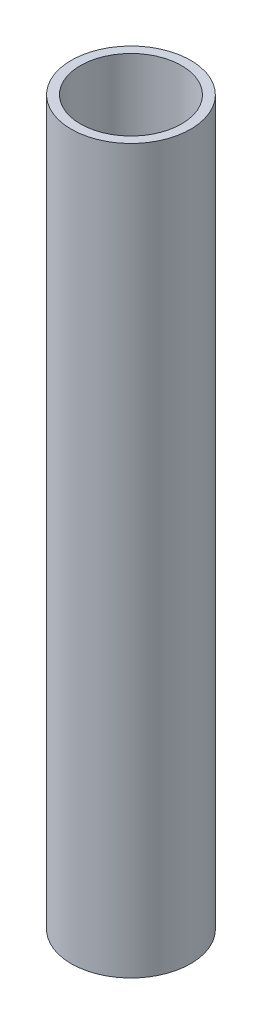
from build123d import *

# Parameters (mm, degrees)
SKETCH1_R      = 24.13
SKETCH1_R_2    = 20.447
EXTRUDE1_DEPTH = 146.05


with BuildPart() as part:
    # Sketch1 → Extrude1 (new, symmetric)
    with BuildSketch(Plane(origin=(0, 0, 0), x_dir=(1, 0, 0), z_dir=(0, 1, 0))):
        with Locations(Location((0, 0, 0), (0, 0, 270))):
            Circle(SKETCH1_R)
        with Locations(Location((0, 0, 0), (0, 0, 270))):
            Circle(SKETCH1_R_2, mode=Mode.SUBTRACT)
    extrude(amount=EXTRUDE1_DEPTH, both=True)


solid = part.part
